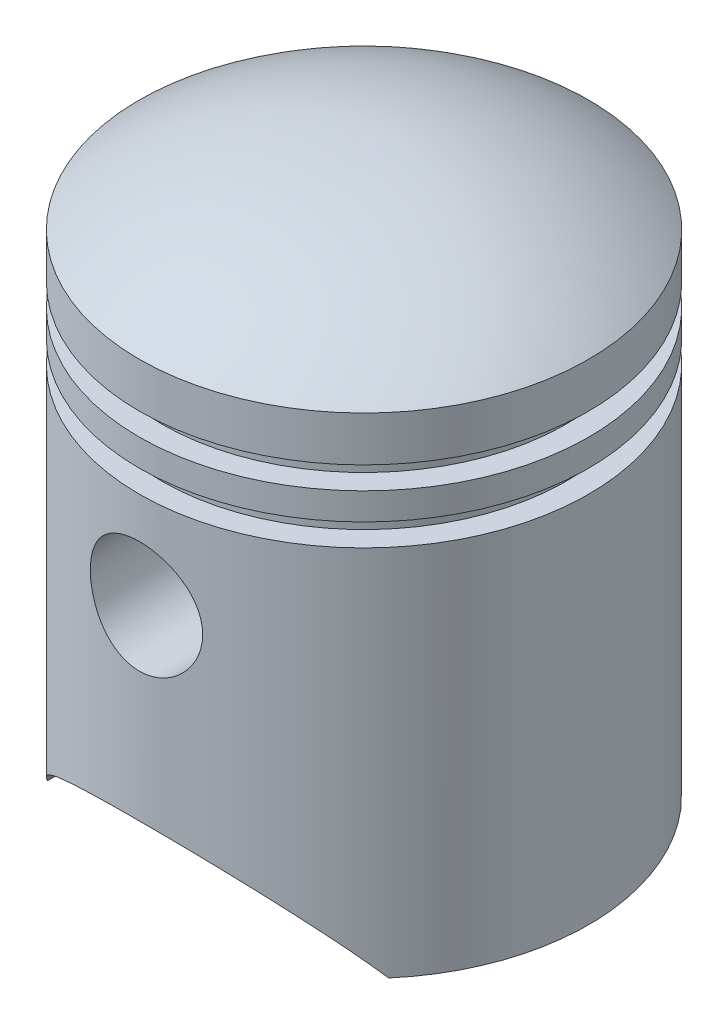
from build123d import *

# Parameters (mm, degrees)
CUT_EXTRUDE1_DEPTH       = 35
SKETCH3_R                = 6.25
CUT_EXTRUDE2_DEPTH       = 40
BOSS_EXTRUDE1_REACH      = 78.823
BOSS_EXTRUDE1_END_RADIUS = 23
SKETCH5_R                = 7.25
SKETCH5_R_2              = 6.25


with BuildPart() as part:
    # Sketch1 → Revolve1 (revolve)
    with BuildSketch(Plane.XY, mode=Mode.PRIVATE) as revolve1_sk:
        with BuildLine():
            Line((0, 62.5), (0, 60.49936285))
            ThreePointArc((0, 60.49936285), (12.069492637, 58.859165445), (23, 53.484511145))
            Line((23, 53.484511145), (23, 51.5))
            Line((23, 51.5), (20.5, 51.5))
            Line((20.5, 51.5), (20.5, 45.5))
            Line((20.5, 45.5), (20.5, 39.5))
            Line((20.5, 39.5), (23, 39.5))
            Line((23, 39.5), (23, 0))
            Line((23, 0), (25, 0))
            Line((25, 0), (25, 41.5))
            Line((25, 41.5), (22.5, 41.5))
            Line((22.5, 41.5), (22.5, 44))
            Line((22.5, 44), (25, 44))
            Line((25, 44), (25, 47))
            Line((25, 47), (22.5, 47))
            Line((22.5, 47), (22.5, 49.5))
            Line((22.5, 49.5), (25, 49.5))
            Line((25, 49.5), (25, 54.5))
            ThreePointArc((25, 54.5), (13.174901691, 60.609067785), (0, 62.5))
        make_face()
    revolve(revolve1_sk.sketch.rotate(Axis((0, 62.5, 0), (0, -1, 0)), 90), axis=Axis((0, 62.5, 0), (0, -1, 0)))

    # Sketch2 → Cut-Extrude1 (cut, symmetric)
    with BuildSketch(Plane.XY):
        with BuildLine():
            Line((19, 0), (-19, 0))
            ThreePointArc((-19, 0), (0, 10.007715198), (19, 0))
        make_face()
    extrude(amount=CUT_EXTRUDE1_DEPTH, both=True, mode=Mode.SUBTRACT)

    # Sketch3 → Cut-Extrude2 (cut, symmetric)
    with BuildSketch(Plane.XY):
        with Locations((0, 30.695967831)):
            Circle(SKETCH3_R)
    extrude(amount=CUT_EXTRUDE2_DEPTH, both=True, mode=Mode.SUBTRACT)

    # Boss-Extrude1: up to this cylinder (the profile starts inside it)
    boss_extrude1_end = Plane(origin=(0, 23.651029, 0), z_dir=(0, 1, 0)) * Cylinder(BOSS_EXTRUDE1_END_RADIUS, 204.646, mode=Mode.PRIVATE)
    # Sketch5 → Boss-Extrude1 (add, up to the surface)
    with BuildSketch(Plane.XY.offset(12), mode=Mode.PRIVATE) as boss_extrude1_sk1:
        with Locations(Location((0, 30.695967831, 0), (0, 0, 90))):
            Circle(SKETCH5_R)
        with Locations((0, 30.695967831)):
            Circle(SKETCH5_R_2, mode=Mode.SUBTRACT)
    boss_extrude1_tool1 = extrude(boss_extrude1_sk1.sketch, amount=BOSS_EXTRUDE1_REACH, mode=Mode.PRIVATE) & boss_extrude1_end
    boss_extrude1 = boss_extrude1_tool1.solids().sort_by_distance((0, 23.651029, 12))[0]
    add(boss_extrude1)

    # Mirror1: Boss-Extrude1 across plane
    add(boss_extrude1.mirror(Plane.XY))


solid = part.part
